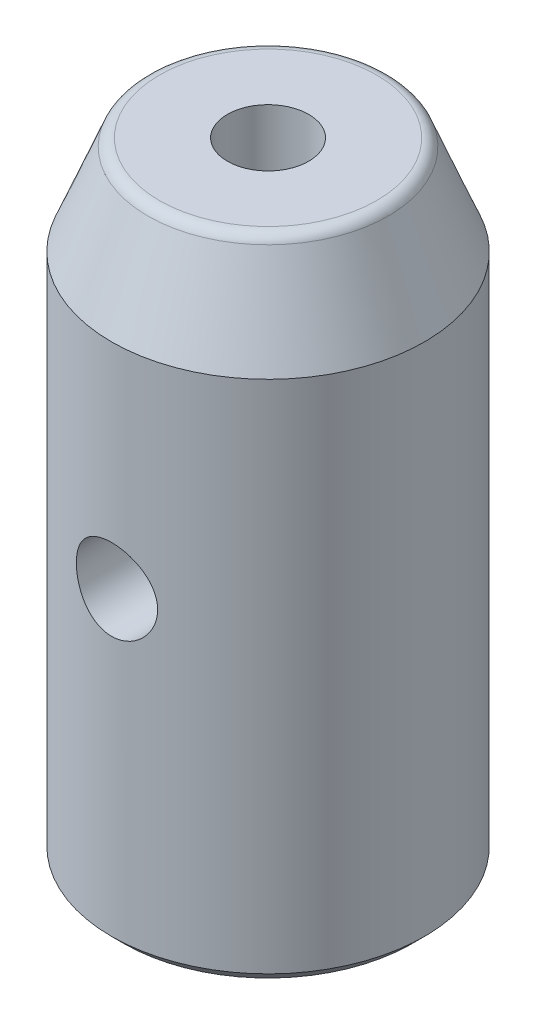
from build123d import *

# Parameters (mm, degrees)
SKETCH_1_R          = 6.35
EXTRUDE_1_DEPTH     = 25.4
M4X0_7_1_D          = 3.3
M4X0_7_1_DEPTH      = 10.1
M4X0_7_1_TIP        = 0.991420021
M6X1_0_1_D          = 5
M6X1_0_1_DEPTH      = 11
M6X1_0_1_TIP        = 1.502151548
CHAMFER_1_SIZE      = 4
CHAMFER_1_SIZE2     = 1.6
FILLET_1_R          = 0.5
CHAMFER_2_SIZE      = 0.5
SKETCH_6_R          = 1.65
CUT_EXTRUDE_1_DEPTH = 30.099355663


with BuildPart() as part:
    # Sketch 1 → Extrude 1 (new body)
    with BuildSketch(Plane(origin=(0, 0, 0), x_dir=(1, 0, 0), z_dir=(0, 1, 0))):
        with Locations(Location((0, 0, 0), (0, 0, 270))):
            Circle(SKETCH_1_R)
    extrude(amount=EXTRUDE_1_DEPTH)

    # M4x0.7 _1
    with Locations(Plane(origin=(0, 25.4, 0), x_dir=(1, 0, 0), z_dir=(0, 1, 0))):
        with Locations((0, 0)):
            Hole(M4X0_7_1_D / 2, depth=M4X0_7_1_DEPTH)
            with Locations((0, 0, -(M4X0_7_1_DEPTH + M4X0_7_1_TIP / 2))):  # 118° drill point
                Cone(0, M4X0_7_1_D / 2, M4X0_7_1_TIP, mode=Mode.SUBTRACT)

    # M6x1.0 _1
    with Locations(Plane(origin=(0, 0, 0), x_dir=(-1, 0, 0), z_dir=(0, -1, 0))):
        with Locations((0, 0)):
            Hole(M6X1_0_1_D / 2, depth=M6X1_0_1_DEPTH)
            with Locations((0, 0, -(M6X1_0_1_DEPTH + M6X1_0_1_TIP / 2))):  # 118° drill point
                Cone(0, M6X1_0_1_D / 2, M6X1_0_1_TIP, mode=Mode.SUBTRACT)

    # Chamfer 1
    chamfer_1_edges = [part.edges().sort_by_distance(p)[0] for p in [
        (0, 25.4, -6.35),
    ]]
    chamfer_1_side = [part.faces().sort_by_distance(p)[0] for p in [
        (0, 12.7, -6.35),
    ]]
    chamfer(chamfer_1_edges, length=CHAMFER_1_SIZE, length2=CHAMFER_1_SIZE2, reference=chamfer_1_side[0])

    # Fillet 1
    fillet_1_edges = [part.edges().sort_by_distance(p)[0] for p in [
        (0, 25.4, -4.75),
    ]]
    fillet(fillet_1_edges, radius=FILLET_1_R)

    # Chamfer 2
    chamfer_2_edges = [part.edges().sort_by_distance(p)[0] for p in [
        (0, 0, -6.35),
    ]]
    chamfer(chamfer_2_edges, length=CHAMFER_2_SIZE)

    # Sketch 6 → Cut-Extrude 1 (cut, through all)
    with BuildSketch(Plane.XY.offset(6.35)):
        with Locations(Location((0, 12.7, 0), (0, 0, 89.999999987))):
            Circle(SKETCH_6_R)
    extrude(amount=-CUT_EXTRUDE_1_DEPTH, mode=Mode.SUBTRACT)


solid = part.part
